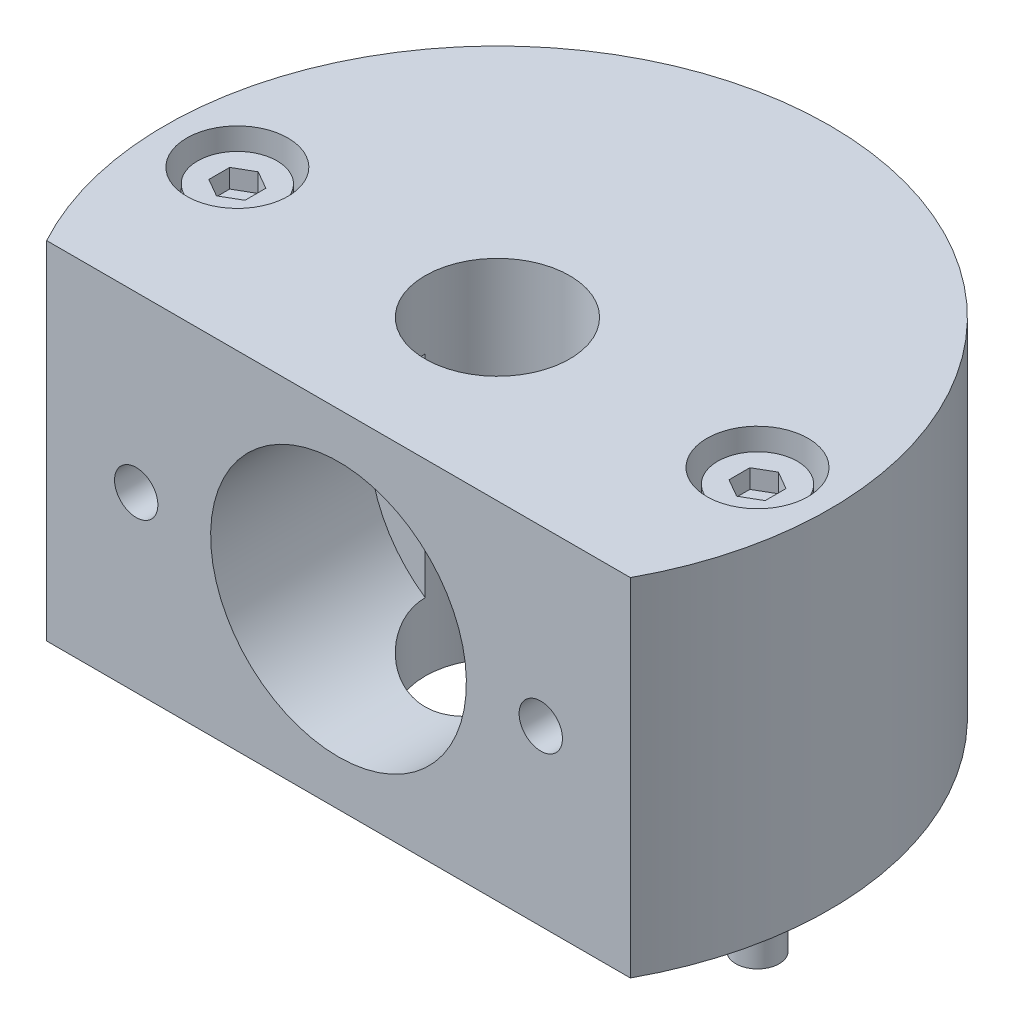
ISO-10303-21;
HEADER;
FILE_DESCRIPTION(('STEP AP214'),'2;1');
FILE_NAME('part.step','',(''),(''),'','','');
FILE_SCHEMA(('AUTOMOTIVE_DESIGN { 1 0 10303 214 1 1 1 1 }'));
ENDSEC;
DATA;
#1=APPLICATION_CONTEXT('core data for automotive mechanical design processes');
#2=APPLICATION_PROTOCOL_DEFINITION('international standard','automotive_design',2000,#1);
#3=PRODUCT_CONTEXT('',#1,'mechanical');
#4=PRODUCT('Part','Part','',(#3));
#5=PRODUCT_RELATED_PRODUCT_CATEGORY('part','',(#4));
#6=PRODUCT_DEFINITION_FORMATION('','',#4);
#7=PRODUCT_DEFINITION_CONTEXT('part definition',#1,'design');
#8=PRODUCT_DEFINITION('design','',#6,#7);
#9=PRODUCT_DEFINITION_SHAPE('','',#8);
#10=(LENGTH_UNIT() NAMED_UNIT(*) SI_UNIT(.MILLI.,.METRE.));
#11=(NAMED_UNIT(*) PLANE_ANGLE_UNIT() SI_UNIT($,.RADIAN.));
#12=(NAMED_UNIT(*) SI_UNIT($,.STERADIAN.) SOLID_ANGLE_UNIT());
#13=UNCERTAINTY_MEASURE_WITH_UNIT(LENGTH_MEASURE(1.E-05),#10,'distance_accuracy_value','');
#14=(GEOMETRIC_REPRESENTATION_CONTEXT(3) GLOBAL_UNCERTAINTY_ASSIGNED_CONTEXT((#13)) GLOBAL_UNIT_ASSIGNED_CONTEXT((#10,
#11,#12)) REPRESENTATION_CONTEXT('',''));
#15=CARTESIAN_POINT('',(0.,0.,0.));
#16=DIRECTION('',(0.,0.,1.));
#17=DIRECTION('',(1.,0.,0.));
#18=AXIS2_PLACEMENT_3D('',#15,#16,#17);
#19=CARTESIAN_POINT('',(12.75,12.,5.));
#20=DIRECTION('',(0.,0.,-1.));
#21=DIRECTION('',(0.,-1.,0.));
#22=AXIS2_PLACEMENT_3D('',#19,#20,#21);
#23=PLANE('',#22);
#24=CARTESIAN_POINT('',(14.,12.0000000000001,5.));
#25=DIRECTION('',(0.,0.,1.));
#26=DIRECTION('',(0.,1.,0.));
#27=AXIS2_PLACEMENT_3D('',#24,#25,#26);
#28=CIRCLE('',#27,1.5);
#29=CARTESIAN_POINT('',(14.,13.5000000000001,4.99999999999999));
#30=VERTEX_POINT('',#29);
#31=EDGE_CURVE('E243',#30,#30,#28,.T.);
#32=ORIENTED_EDGE('',*,*,#31,.T.);
#33=EDGE_LOOP('',(#32));
#34=FACE_BOUND('',#33,.T.);
#35=ADVANCED_FACE('F14',(#34),#23,.F.);
#36=CARTESIAN_POINT('',(14.,12.0000000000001,11.));
#37=DIRECTION('',(0.,0.,1.));
#38=DIRECTION('',(0.,1.,0.));
#39=AXIS2_PLACEMENT_3D('',#36,#37,#38);
#40=CYLINDRICAL_SURFACE('',#39,1.5);
#41=ORIENTED_EDGE('',*,*,#31,.F.);
#42=EDGE_LOOP('',(#41));
#43=FACE_BOUND('',#42,.T.);
#44=CARTESIAN_POINT('',(14.,12.0000000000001,11.));
#45=DIRECTION('',(0.,0.,-1.));
#46=DIRECTION('',(0.,1.,0.));
#47=AXIS2_PLACEMENT_3D('',#44,#45,#46);
#48=CIRCLE('',#47,1.5);
#49=CARTESIAN_POINT('',(14.,13.5000000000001,11.));
#50=VERTEX_POINT('',#49);
#51=EDGE_CURVE('E414',#50,#50,#48,.F.);
#52=ORIENTED_EDGE('',*,*,#51,.T.);
#53=EDGE_LOOP('',(#52));
#54=FACE_BOUND('',#53,.T.);
#55=ADVANCED_FACE('F16',(#43,#54),#40,.F.);
#56=CARTESIAN_POINT('',(20.199009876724,24.,11.));
#57=DIRECTION('',(0.,0.,-1.));
#58=DIRECTION('',(0.,-1.,0.));
#59=AXIS2_PLACEMENT_3D('',#56,#57,#58);
#60=PLANE('',#59);
#61=ORIENTED_EDGE('',*,*,#51,.F.);
#62=EDGE_LOOP('',(#61));
#63=FACE_BOUND('',#62,.T.);
#64=DIRECTION('',(0.,-1.,0.));
#65=VECTOR('',#64,1.);
#66=CARTESIAN_POINT('',(20.199009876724,24.,11.));
#67=LINE('',#66,#65);
#68=CARTESIAN_POINT('',(20.199009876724,24.,11.));
#69=VERTEX_POINT('',#68);
#70=CARTESIAN_POINT('',(20.1990098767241,1.79455226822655E-13,11.));
#71=VERTEX_POINT('',#70);
#72=EDGE_CURVE('E253',#69,#71,#67,.T.);
#73=ORIENTED_EDGE('',*,*,#72,.F.);
#74=DIRECTION('',(-1.,0.,0.));
#75=VECTOR('',#74,1.);
#76=CARTESIAN_POINT('',(-1.6759110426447E-13,24.,11.));
#77=LINE('',#76,#75);
#78=CARTESIAN_POINT('',(-20.1990098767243,24.,11.));
#79=VERTEX_POINT('',#78);
#80=EDGE_CURVE('E28',#69,#79,#77,.T.);
#81=ORIENTED_EDGE('',*,*,#80,.T.);
#82=DIRECTION('',(0.,-1.,0.));
#83=VECTOR('',#82,1.);
#84=CARTESIAN_POINT('',(-20.1990098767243,24.,11.));
#85=LINE('',#84,#83);
#86=CARTESIAN_POINT('',(-20.1990098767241,-1.02642637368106E-13,11.));
#87=VERTEX_POINT('',#86);
#88=EDGE_CURVE('E256',#79,#87,#85,.T.);
#89=ORIENTED_EDGE('',*,*,#88,.T.);
#90=DIRECTION('',(1.,0.,0.));
#91=VECTOR('',#90,1.);
#92=CARTESIAN_POINT('',(20.1990098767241,1.79455226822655E-13,11.));
#93=LINE('',#92,#91);
#94=EDGE_CURVE('E462',#87,#71,#93,.T.);
#95=ORIENTED_EDGE('',*,*,#94,.T.);
#96=EDGE_LOOP('',(#73,#81,#89,#95));
#97=FACE_BOUND('',#96,.T.);
#98=CARTESIAN_POINT('',(0.,12.,11.));
#99=DIRECTION('',(0.,0.,-1.));
#100=DIRECTION('',(0.,-1.,0.));
#101=AXIS2_PLACEMENT_3D('',#98,#99,#100);
#102=CIRCLE('',#101,8.85);
#103=CARTESIAN_POINT('',(0.,3.15,11.));
#104=VERTEX_POINT('',#103);
#105=EDGE_CURVE('E457',#104,#104,#102,.F.);
#106=ORIENTED_EDGE('',*,*,#105,.F.);
#107=EDGE_LOOP('',(#106));
#108=FACE_BOUND('',#107,.T.);
#109=CARTESIAN_POINT('',(-14.,12.,11.));
#110=DIRECTION('',(0.,0.,-1.));
#111=DIRECTION('',(0.,1.,0.));
#112=AXIS2_PLACEMENT_3D('',#109,#110,#111);
#113=CIRCLE('',#112,1.5);
#114=CARTESIAN_POINT('',(-14.,13.5,11.));
#115=VERTEX_POINT('',#114);
#116=EDGE_CURVE('E9',#115,#115,#113,.T.);
#117=ORIENTED_EDGE('',*,*,#116,.T.);
#118=EDGE_LOOP('',(#117));
#119=FACE_BOUND('',#118,.T.);
#120=ADVANCED_FACE('F477',(#63,#97,#108,#119),#60,.F.);
#121=CARTESIAN_POINT('',(0.,0.,0.));
#122=DIRECTION('',(0.,1.,0.));
#123=DIRECTION('',(-1.,0.,0.));
#124=AXIS2_PLACEMENT_3D('',#121,#122,#123);
#125=PLANE('',#124);
#126=CARTESIAN_POINT('',(18.,1.25693328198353E-13,0.));
#127=DIRECTION('',(0.,1.,0.));
#128=DIRECTION('',(-1.,0.,0.));
#129=AXIS2_PLACEMENT_3D('',#126,#127,#128);
#130=CIRCLE('',#129,1.75);
#131=CARTESIAN_POINT('',(16.25,1.13473143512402E-13,0.));
#132=VERTEX_POINT('',#131);
#133=EDGE_CURVE('E236',#132,#132,#130,.T.);
#134=ORIENTED_EDGE('',*,*,#133,.T.);
#135=EDGE_LOOP('',(#134));
#136=FACE_BOUND('',#135,.T.);
#137=CARTESIAN_POINT('',(0.,0.,0.));
#138=DIRECTION('',(0.,1.,0.));
#139=DIRECTION('',(-1.,0.,0.));
#140=AXIS2_PLACEMENT_3D('',#137,#138,#139);
#141=CIRCLE('',#140,5.);
#142=CARTESIAN_POINT('',(-5.,0.,0.));
#143=VERTEX_POINT('',#142);
#144=EDGE_CURVE('E770',#143,#143,#141,.T.);
#145=ORIENTED_EDGE('',*,*,#144,.T.);
#146=EDGE_LOOP('',(#145));
#147=FACE_BOUND('',#146,.T.);
#148=ORIENTED_EDGE('',*,*,#94,.F.);
#149=CARTESIAN_POINT('',(0.,0.,0.));
#150=DIRECTION('',(0.,1.,0.));
#151=DIRECTION('',(-1.,0.,0.));
#152=AXIS2_PLACEMENT_3D('',#149,#150,#151);
#153=CIRCLE('',#152,23.);
#154=EDGE_CURVE('E459',#71,#87,#153,.T.);
#155=ORIENTED_EDGE('',*,*,#154,.F.);
#156=EDGE_LOOP('',(#148,#155));
#157=FACE_BOUND('',#156,.T.);
#158=CARTESIAN_POINT('',(-18.,-1.25693328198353E-13,0.));
#159=DIRECTION('',(0.,1.,0.));
#160=DIRECTION('',(-1.,0.,0.));
#161=AXIS2_PLACEMENT_3D('',#158,#159,#160);
#162=CIRCLE('',#161,1.75);
#163=CARTESIAN_POINT('',(-19.75,-1.37913512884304E-13,0.));
#164=VERTEX_POINT('',#163);
#165=EDGE_CURVE('E464',#164,#164,#162,.T.);
#166=ORIENTED_EDGE('',*,*,#165,.T.);
#167=EDGE_LOOP('',(#166));
#168=FACE_BOUND('',#167,.T.);
#169=ADVANCED_FACE('F481',(#136,#147,#157,#168),#125,.F.);
#170=CARTESIAN_POINT('',(-1.6759110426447E-13,24.,0.));
#171=DIRECTION('',(0.,-1.,0.));
#172=DIRECTION('',(1.,0.,0.));
#173=AXIS2_PLACEMENT_3D('',#170,#171,#172);
#174=CYLINDRICAL_SURFACE('',#173,23.);
#175=ORIENTED_EDGE('',*,*,#88,.F.);
#176=CARTESIAN_POINT('',(-1.6759110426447E-13,24.,0.));
#177=DIRECTION('',(0.,1.,0.));
#178=DIRECTION('',(-1.,0.,0.));
#179=AXIS2_PLACEMENT_3D('',#176,#177,#178);
#180=CIRCLE('',#179,23.);
#181=EDGE_CURVE('E473',#79,#69,#180,.F.);
#182=ORIENTED_EDGE('',*,*,#181,.T.);
#183=ORIENTED_EDGE('',*,*,#72,.T.);
#184=ORIENTED_EDGE('',*,*,#154,.T.);
#185=EDGE_LOOP('',(#175,#182,#183,#184));
#186=FACE_BOUND('',#185,.T.);
#187=ADVANCED_FACE('F476',(#186),#174,.T.);
#188=CARTESIAN_POINT('',(-1.6759110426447E-13,24.,0.));
#189=DIRECTION('',(0.,-1.,0.));
#190=DIRECTION('',(1.,0.,0.));
#191=AXIS2_PLACEMENT_3D('',#188,#189,#190);
#192=CYLINDRICAL_SURFACE('',#191,5.);
#193=ORIENTED_EDGE('',*,*,#144,.F.);
#194=EDGE_LOOP('',(#193));
#195=FACE_BOUND('',#194,.T.);
#196=CARTESIAN_POINT('',(-1.6759110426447E-13,24.,0.));
#197=DIRECTION('',(0.,1.,0.));
#198=DIRECTION('',(-1.,0.,0.));
#199=AXIS2_PLACEMENT_3D('',#196,#197,#198);
#200=CIRCLE('',#199,5.);
#201=CARTESIAN_POINT('',(-5.00000000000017,24.,0.));
#202=VERTEX_POINT('',#201);
#203=EDGE_CURVE('E772',#202,#202,#200,.T.);
#204=ORIENTED_EDGE('',*,*,#203,.T.);
#205=EDGE_LOOP('',(#204));
#206=FACE_BOUND('',#205,.T.);
#207=CARTESIAN_POINT('',(4.99999999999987,19.3022256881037,0.));
#208=CARTESIAN_POINT('',(5.00002648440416,19.3021780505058,0.128135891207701));
#209=CARTESIAN_POINT('',(4.99507539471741,19.305597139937,0.256244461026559));
#210=CARTESIAN_POINT('',(4.97542775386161,19.3190077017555,0.511262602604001));
#211=CARTESIAN_POINT('',(4.96073928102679,19.3289937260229,0.638173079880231));
#212=CARTESIAN_POINT('',(4.92196495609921,19.3550846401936,0.888967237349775));
#213=CARTESIAN_POINT('',(4.89794700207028,19.3711452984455,1.01286606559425));
#214=CARTESIAN_POINT('',(4.8408698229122,19.4087547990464,1.25769484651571));
#215=CARTESIAN_POINT('',(4.80780909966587,19.4303045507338,1.3786243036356));
#216=CARTESIAN_POINT('',(4.69587952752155,19.5019384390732,1.73508205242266));
#217=CARTESIAN_POINT('',(4.6041063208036,19.5591198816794,1.96526830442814));
#218=CARTESIAN_POINT('',(4.38933279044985,19.6858154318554,2.40715136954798));
#219=CARTESIAN_POINT('',(4.26626996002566,19.7553541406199,2.61881001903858));
#220=CARTESIAN_POINT('',(3.97720793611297,19.9078301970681,3.04208564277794));
#221=CARTESIAN_POINT('',(3.80803486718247,19.991406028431,3.25130567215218));
#222=CARTESIAN_POINT('',(3.43798814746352,20.1574375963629,3.64036687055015));
#223=CARTESIAN_POINT('',(3.23710415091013,20.2398929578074,3.82019841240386));
#224=CARTESIAN_POINT('',(2.90464650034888,20.3606954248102,4.07244508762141));
#225=CARTESIAN_POINT('',(2.78292411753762,20.4020960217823,4.15660416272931));
#226=CARTESIAN_POINT('',(2.53163884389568,20.4811921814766,4.3142529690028));
#227=CARTESIAN_POINT('',(2.40207917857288,20.5188892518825,4.3877470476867));
#228=CARTESIAN_POINT('',(2.13591341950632,20.589489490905,4.52329235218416));
#229=CARTESIAN_POINT('',(1.99930975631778,20.6223942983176,4.58534749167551));
#230=CARTESIAN_POINT('',(1.71997299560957,20.6824297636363,4.69726721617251));
#231=CARTESIAN_POINT('',(1.57724077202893,20.7095612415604,4.74713353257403));
#232=CARTESIAN_POINT('',(1.29943128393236,20.7551151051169,4.83017977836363));
#233=CARTESIAN_POINT('',(1.16476468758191,20.774088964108,4.86443225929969));
#234=CARTESIAN_POINT('',(0.892361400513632,20.8059631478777,4.92169221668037));
#235=CARTESIAN_POINT('',(0.754625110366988,20.8188642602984,4.94470115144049));
#236=CARTESIAN_POINT('',(0.477347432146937,20.8382092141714,4.97912087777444));
#237=CARTESIAN_POINT('',(0.337807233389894,20.8446571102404,4.99053895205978));
#238=CARTESIAN_POINT('',(0.0581169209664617,20.8509142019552,5.00162017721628));
#239=CARTESIAN_POINT('',(-0.0820331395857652,20.8507239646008,5.00128433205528));
#240=CARTESIAN_POINT('',(-0.346154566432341,20.8441027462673,4.9895561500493));
#241=CARTESIAN_POINT('',(-0.470200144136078,20.8383646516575,4.97939135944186));
#242=CARTESIAN_POINT('',(-0.716890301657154,20.8217830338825,4.94989946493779));
#243=CARTESIAN_POINT('',(-0.839534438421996,20.8109379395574,4.9305695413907));
#244=CARTESIAN_POINT('',(-1.08249932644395,20.7843962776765,4.88298161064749));
#245=CARTESIAN_POINT('',(-1.2028208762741,20.7687014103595,4.85472673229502));
#246=CARTESIAN_POINT('',(-1.44044129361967,20.7328175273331,4.78960658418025));
#247=CARTESIAN_POINT('',(-1.55773897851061,20.712626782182,4.75273800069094));
#248=CARTESIAN_POINT('',(-1.90613437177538,20.6455329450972,4.6289999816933));
#249=CARTESIAN_POINT('',(-2.13165734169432,20.5923452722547,4.52941037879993));
#250=CARTESIAN_POINT('',(-2.5630654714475,20.4736905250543,4.30006173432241));
#251=CARTESIAN_POINT('',(-2.7689447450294,20.4082197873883,4.17029368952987));
#252=CARTESIAN_POINT('',(-3.17991759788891,20.2621598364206,3.8678504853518));
#253=CARTESIAN_POINT('',(-3.38236787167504,20.180698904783,3.69200564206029));
#254=CARTESIAN_POINT('',(-3.7566160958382,20.0157484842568,3.31048734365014));
#255=CARTESIAN_POINT('',(-3.92837243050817,19.9322564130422,3.1047740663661));
#256=CARTESIAN_POINT('',(-4.16783999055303,19.8077393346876,2.76599540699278));
#257=CARTESIAN_POINT('',(-4.24753136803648,19.7645497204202,2.64202759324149));
#258=CARTESIAN_POINT('',(-4.39610514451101,19.6814059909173,2.38664497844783));
#259=CARTESIAN_POINT('',(-4.46498484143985,19.6414526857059,2.2552283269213));
#260=CARTESIAN_POINT('',(-4.59105329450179,19.5663799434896,1.98601835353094));
#261=CARTESIAN_POINT('',(-4.6482720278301,19.5312481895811,1.84824252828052));
#262=CARTESIAN_POINT('',(-4.75048745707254,19.4671957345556,1.5669178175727));
#263=CARTESIAN_POINT('',(-4.79549399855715,19.4382700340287,1.42337369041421));
#264=CARTESIAN_POINT('',(-4.86124923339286,19.395390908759,1.1745633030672));
#265=CARTESIAN_POINT('',(-4.88523867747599,19.3795366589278,1.07046882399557));
#266=CARTESIAN_POINT('',(-4.92656966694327,19.352008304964,0.860442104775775));
#267=CARTESIAN_POINT('',(-4.94391316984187,19.3403329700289,0.754510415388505));
#268=CARTESIAN_POINT('',(-4.97183302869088,19.3214533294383,0.540857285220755));
#269=CARTESIAN_POINT('',(-4.98237763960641,19.3142700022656,0.433129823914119));
#270=CARTESIAN_POINT('',(-4.99647051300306,19.3046420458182,0.216939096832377));
#271=CARTESIAN_POINT('',(-5.00001423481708,19.302200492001,0.108475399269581));
#272=CARTESIAN_POINT('',(-5.00000000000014,19.3022256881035,0.));
#273=B_SPLINE_CURVE_WITH_KNOTS('',3,(#207,#208,#209,#210,#211,#212,#213,#214,#215,#216,#217,
#218,#219,#220,#221,#222,#223,#224,#225,#226,#227,#228,#229,#230,#231,#232,#233,#234,#235,#236,
#237,#238,#239,#240,#241,#242,#243,#244,#245,#246,#247,#248,#249,#250,#251,#252,#253,#254,#255,
#256,#257,#258,#259,#260,#261,#262,#263,#264,#265,#266,#267,#268,#269,#270,#271,#272),
.UNSPECIFIED.,.F.,.F.,(4,2,2,2,2,2,2,2,2,2,2,2,2,2,2,2,2,2,2,2,2,2,2,2,2,2,2,2,2,2,2,2,4),(0.,
0.384222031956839,0.768125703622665,1.14928622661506,1.53050993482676,2.28997373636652,
3.05096679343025,3.89286756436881,4.73504357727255,5.19552222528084,5.65581263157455,
6.11594526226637,6.5760124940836,6.99615288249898,7.41623876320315,7.83606053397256,
8.25584644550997,8.62918178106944,9.0026320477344,9.37595153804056,9.74941488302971,
10.5026594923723,11.2561291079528,12.0935485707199,12.9320949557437,13.3923122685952,
13.8526444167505,14.3117778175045,14.7705399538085,15.0942462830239,15.4178571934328,
15.7429683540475,16.0682903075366),.UNSPECIFIED.);
#274=CARTESIAN_POINT('',(4.99999999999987,19.3022256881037,0.));
#275=VERTEX_POINT('',#274);
#276=CARTESIAN_POINT('',(-5.00000000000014,19.3022256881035,0.));
#277=VERTEX_POINT('',#276);
#278=EDGE_CURVE('E270',#275,#277,#273,.T.);
#279=ORIENTED_EDGE('',*,*,#278,.T.);
#280=DIRECTION('',(0.,-1.,0.));
#281=VECTOR('',#280,1.);
#282=CARTESIAN_POINT('',(-5.00000000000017,24.,0.));
#283=LINE('',#282,#281);
#284=CARTESIAN_POINT('',(-5.,4.69777431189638,0.));
#285=VERTEX_POINT('',#284);
#286=EDGE_CURVE('E765',#277,#285,#283,.T.);
#287=ORIENTED_EDGE('',*,*,#286,.T.);
#288=CARTESIAN_POINT('',(-5.,4.69777431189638,0.));
#289=CARTESIAN_POINT('',(-5.00002648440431,4.69782194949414,0.128135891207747));
#290=CARTESIAN_POINT('',(-4.99507539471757,4.69440286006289,0.256244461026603));
#291=CARTESIAN_POINT('',(-4.97542775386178,4.68099229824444,0.511262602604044));
#292=CARTESIAN_POINT('',(-4.96073928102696,4.67100627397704,0.638173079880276));
#293=CARTESIAN_POINT('',(-4.92196495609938,4.64491535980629,0.888967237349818));
#294=CARTESIAN_POINT('',(-4.89794700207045,4.6288547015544,1.01286606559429));
#295=CARTESIAN_POINT('',(-4.84086982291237,4.59124520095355,1.25769484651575));
#296=CARTESIAN_POINT('',(-4.80780909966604,4.56969544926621,1.37862430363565));
#297=CARTESIAN_POINT('',(-4.69587952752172,4.49806156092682,1.73508205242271));
#298=CARTESIAN_POINT('',(-4.60410632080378,4.44088011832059,1.96526830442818));
#299=CARTESIAN_POINT('',(-4.38933279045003,4.31418456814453,2.40715136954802));
#300=CARTESIAN_POINT('',(-4.26626996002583,4.24464585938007,2.61881001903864));
#301=CARTESIAN_POINT('',(-3.97720793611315,4.09216980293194,3.04208564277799));
#302=CARTESIAN_POINT('',(-3.80803486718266,4.00859397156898,3.25130567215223));
#303=CARTESIAN_POINT('',(-3.43798814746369,3.84256240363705,3.64036687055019));
#304=CARTESIAN_POINT('',(-3.23710415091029,3.7601070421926,3.82019841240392));
#305=CARTESIAN_POINT('',(-2.90464650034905,3.63930457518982,4.07244508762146));
#306=CARTESIAN_POINT('',(-2.7829241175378,3.59790397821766,4.15660416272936));
#307=CARTESIAN_POINT('',(-2.53163884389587,3.5188078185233,4.31425296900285));
#308=CARTESIAN_POINT('',(-2.40207917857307,3.48111074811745,4.38774704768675));
#309=CARTESIAN_POINT('',(-2.13591341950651,3.41051050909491,4.52329235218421));
#310=CARTESIAN_POINT('',(-1.99930975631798,3.37760570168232,4.58534749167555));
#311=CARTESIAN_POINT('',(-1.71997299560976,3.31757023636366,4.69726721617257));
#312=CARTESIAN_POINT('',(-1.5772407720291,3.29043875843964,4.74713353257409));
#313=CARTESIAN_POINT('',(-1.29943128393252,3.24488489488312,4.83017977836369));
#314=CARTESIAN_POINT('',(-1.16476468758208,3.22591103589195,4.86443225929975));
#315=CARTESIAN_POINT('',(-0.892361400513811,3.19403685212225,4.92169221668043));
#316=CARTESIAN_POINT('',(-0.754625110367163,3.18113573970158,4.94470115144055));
#317=CARTESIAN_POINT('',(-0.477347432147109,3.16179078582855,4.97912087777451));
#318=CARTESIAN_POINT('',(-0.337807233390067,3.1553428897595,4.99053895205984));
#319=CARTESIAN_POINT('',(-0.0581169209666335,3.14908579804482,5.00162017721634));
#320=CARTESIAN_POINT('',(0.0820331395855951,3.14927603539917,5.00128433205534));
#321=CARTESIAN_POINT('',(0.346154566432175,3.15589725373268,4.98955615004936));
#322=CARTESIAN_POINT('',(0.470200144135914,3.16163534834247,4.97939135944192));
#323=CARTESIAN_POINT('',(0.716890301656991,3.17821696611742,4.94989946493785));
#324=CARTESIAN_POINT('',(0.839534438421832,3.18906206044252,4.93056954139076));
#325=CARTESIAN_POINT('',(1.08249932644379,3.21560372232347,4.88298161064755));
#326=CARTESIAN_POINT('',(1.20282087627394,3.23129858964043,4.85472673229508));
#327=CARTESIAN_POINT('',(1.44044129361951,3.26718247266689,4.78960658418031));
#328=CARTESIAN_POINT('',(1.55773897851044,3.28737321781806,4.752738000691));
#329=CARTESIAN_POINT('',(1.90613437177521,3.35446705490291,4.62899998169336));
#330=CARTESIAN_POINT('',(2.13165734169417,3.40765472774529,4.52941037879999));
#331=CARTESIAN_POINT('',(2.56306547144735,3.52630947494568,4.30006173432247));
#332=CARTESIAN_POINT('',(2.76894474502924,3.59178021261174,4.17029368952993));
#333=CARTESIAN_POINT('',(3.17991759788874,3.73784016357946,3.86785048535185));
#334=CARTESIAN_POINT('',(3.38236787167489,3.81930109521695,3.69200564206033));
#335=CARTESIAN_POINT('',(3.75661609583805,3.98425151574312,3.31048734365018));
#336=CARTESIAN_POINT('',(3.92837243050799,4.06774358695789,3.10477406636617));
#337=CARTESIAN_POINT('',(4.16783999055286,4.19226066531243,2.76599540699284));
#338=CARTESIAN_POINT('',(4.24753136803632,4.23545027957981,2.64202759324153));
#339=CARTESIAN_POINT('',(4.39610514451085,4.31859400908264,2.38664497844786));
#340=CARTESIAN_POINT('',(4.46498484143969,4.35854731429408,2.25522832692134));
#341=CARTESIAN_POINT('',(4.59105329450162,4.43362005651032,1.98601835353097));
#342=CARTESIAN_POINT('',(4.64827202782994,4.46875181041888,1.84824252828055));
#343=CARTESIAN_POINT('',(4.75048745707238,4.53280426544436,1.56691781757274));
#344=CARTESIAN_POINT('',(4.79549399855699,4.56172996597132,1.42337369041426));
#345=CARTESIAN_POINT('',(4.8612492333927,4.604609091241,1.17456330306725));
#346=CARTESIAN_POINT('',(4.88523867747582,4.62046334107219,1.07046882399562));
#347=CARTESIAN_POINT('',(4.9265696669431,4.64799169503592,0.860442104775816));
#348=CARTESIAN_POINT('',(4.94391316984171,4.65966702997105,0.754510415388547));
#349=CARTESIAN_POINT('',(4.97183302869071,4.67854667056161,0.540857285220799));
#350=CARTESIAN_POINT('',(4.98237763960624,4.68572999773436,0.433129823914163));
#351=CARTESIAN_POINT('',(4.9964705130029,4.69535795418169,0.216939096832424));
#352=CARTESIAN_POINT('',(5.00001423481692,4.69779950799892,0.108475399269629));
#353=CARTESIAN_POINT('',(5.,4.69777431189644,0.));
#354=B_SPLINE_CURVE_WITH_KNOTS('',3,(#288,#289,#290,#291,#292,#293,#294,#295,#296,#297,#298,
#299,#300,#301,#302,#303,#304,#305,#306,#307,#308,#309,#310,#311,#312,#313,#314,#315,#316,#317,
#318,#319,#320,#321,#322,#323,#324,#325,#326,#327,#328,#329,#330,#331,#332,#333,#334,#335,#336,
#337,#338,#339,#340,#341,#342,#343,#344,#345,#346,#347,#348,#349,#350,#351,#352,#353),
.UNSPECIFIED.,.F.,.F.,(4,2,2,2,2,2,2,2,2,2,2,2,2,2,2,2,2,2,2,2,2,2,2,2,2,2,2,2,2,2,2,2,4),(0.,
0.384222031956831,0.768125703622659,1.14928622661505,1.53050993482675,2.2899737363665,
3.05096679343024,3.89286756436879,4.73504357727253,5.19552222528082,5.65581263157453,
6.11594526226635,6.57601249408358,6.99615288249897,7.41623876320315,7.83606053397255,
8.25584644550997,8.62918178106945,9.0026320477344,9.37595153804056,9.74941488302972,
10.5026594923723,11.2561291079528,12.0935485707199,12.9320949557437,13.3923122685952,
13.8526444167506,14.3117778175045,14.7705399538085,15.0942462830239,15.4178571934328,
15.7429683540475,16.0682903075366),.UNSPECIFIED.);
#355=CARTESIAN_POINT('',(5.,4.69777431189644,0.));
#356=VERTEX_POINT('',#355);
#357=EDGE_CURVE('E261',#285,#356,#354,.T.);
#358=ORIENTED_EDGE('',*,*,#357,.T.);
#359=DIRECTION('',(0.,-1.,0.));
#360=VECTOR('',#359,1.);
#361=CARTESIAN_POINT('',(4.99999999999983,24.,0.));
#362=LINE('',#361,#360);
#363=EDGE_CURVE('E258',#356,#275,#362,.F.);
#364=ORIENTED_EDGE('',*,*,#363,.T.);
#365=EDGE_LOOP('',(#279,#287,#358,#364));
#366=FACE_BOUND('',#365,.T.);
#367=ADVANCED_FACE('F276',(#195,#206,#366),#192,.F.);
#368=CARTESIAN_POINT('',(-1.6759110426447E-13,24.,0.));
#369=DIRECTION('',(0.,1.,0.));
#370=DIRECTION('',(-1.,0.,0.));
#371=AXIS2_PLACEMENT_3D('',#368,#369,#370);
#372=PLANE('',#371);
#373=ORIENTED_EDGE('',*,*,#80,.F.);
#374=ORIENTED_EDGE('',*,*,#181,.F.);
#375=EDGE_LOOP('',(#373,#374));
#376=FACE_BOUND('',#375,.T.);
#377=CARTESIAN_POINT('',(18.,24.,0.));
#378=DIRECTION('',(0.,1.,0.));
#379=DIRECTION('',(-1.,0.,0.));
#380=AXIS2_PLACEMENT_3D('',#377,#378,#379);
#381=CIRCLE('',#380,3.5);
#382=CARTESIAN_POINT('',(14.5,24.,0.));
#383=VERTEX_POINT('',#382);
#384=EDGE_CURVE('E470',#383,#383,#381,.T.);
#385=ORIENTED_EDGE('',*,*,#384,.F.);
#386=EDGE_LOOP('',(#385));
#387=FACE_BOUND('',#386,.T.);
#388=CARTESIAN_POINT('',(-18.,24.,0.));
#389=DIRECTION('',(0.,1.,0.));
#390=DIRECTION('',(-1.,0.,0.));
#391=AXIS2_PLACEMENT_3D('',#388,#389,#390);
#392=CIRCLE('',#391,3.5);
#393=CARTESIAN_POINT('',(-21.5,24.,0.));
#394=VERTEX_POINT('',#393);
#395=EDGE_CURVE('E467',#394,#394,#392,.T.);
#396=ORIENTED_EDGE('',*,*,#395,.F.);
#397=EDGE_LOOP('',(#396));
#398=FACE_BOUND('',#397,.T.);
#399=ORIENTED_EDGE('',*,*,#203,.F.);
#400=EDGE_LOOP('',(#399));
#401=FACE_BOUND('',#400,.T.);
#402=ADVANCED_FACE('F498',(#376,#387,#398,#401),#372,.T.);
#403=CARTESIAN_POINT('',(0.,12.,0.));
#404=DIRECTION('',(0.,0.,1.));
#405=DIRECTION('',(0.,1.,0.));
#406=AXIS2_PLACEMENT_3D('',#403,#404,#405);
#407=PLANE('',#406);
#408=CARTESIAN_POINT('',(0.,12.,0.));
#409=DIRECTION('',(0.,0.,1.));
#410=DIRECTION('',(0.,1.,0.));
#411=AXIS2_PLACEMENT_3D('',#408,#409,#410);
#412=CIRCLE('',#411,8.85);
#413=EDGE_CURVE('E250',#277,#285,#412,.T.);
#414=ORIENTED_EDGE('',*,*,#413,.T.);
#415=ORIENTED_EDGE('',*,*,#286,.F.);
#416=EDGE_LOOP('',(#414,#415));
#417=FACE_BOUND('',#416,.T.);
#418=ADVANCED_FACE('F284',(#417),#407,.T.);
#419=CARTESIAN_POINT('',(0.,12.,11.));
#420=DIRECTION('',(0.,0.,-1.));
#421=DIRECTION('',(0.,-1.,0.));
#422=AXIS2_PLACEMENT_3D('',#419,#420,#421);
#423=CYLINDRICAL_SURFACE('',#422,8.85);
#424=ORIENTED_EDGE('',*,*,#105,.T.);
#425=EDGE_LOOP('',(#424));
#426=FACE_BOUND('',#425,.T.);
#427=EDGE_CURVE('E249',#356,#275,#412,.T.);
#428=ORIENTED_EDGE('',*,*,#427,.F.);
#429=ORIENTED_EDGE('',*,*,#357,.F.);
#430=ORIENTED_EDGE('',*,*,#413,.F.);
#431=ORIENTED_EDGE('',*,*,#278,.F.);
#432=EDGE_LOOP('',(#428,#429,#430,#431));
#433=FACE_BOUND('',#432,.T.);
#434=ADVANCED_FACE('F279',(#426,#433),#423,.F.);
#435=ORIENTED_EDGE('',*,*,#427,.T.);
#436=ORIENTED_EDGE('',*,*,#363,.F.);
#437=EDGE_LOOP('',(#435,#436));
#438=FACE_BOUND('',#437,.T.);
#439=ADVANCED_FACE('F283',(#438),#407,.T.);
#440=CARTESIAN_POINT('',(-18.,24.,0.));
#441=DIRECTION('',(0.,1.,0.));
#442=DIRECTION('',(-1.,0.,0.));
#443=AXIS2_PLACEMENT_3D('',#440,#441,#442);
#444=CYLINDRICAL_SURFACE('',#443,3.5);
#445=CARTESIAN_POINT('',(-18.,20.,0.));
#446=DIRECTION('',(0.,1.,0.));
#447=DIRECTION('',(-1.,0.,0.));
#448=AXIS2_PLACEMENT_3D('',#445,#446,#447);
#449=CIRCLE('',#448,3.5);
#450=CARTESIAN_POINT('',(-21.5,20.,0.));
#451=VERTEX_POINT('',#450);
#452=EDGE_CURVE('E240',#451,#451,#449,.T.);
#453=ORIENTED_EDGE('',*,*,#452,.F.);
#454=EDGE_LOOP('',(#453));
#455=FACE_BOUND('',#454,.T.);
#456=ORIENTED_EDGE('',*,*,#395,.T.);
#457=EDGE_LOOP('',(#456));
#458=FACE_BOUND('',#457,.T.);
#459=ADVANCED_FACE('F289',(#455,#458),#444,.F.);
#460=CARTESIAN_POINT('',(-21.5,20.,0.));
#461=DIRECTION('',(0.,-1.,0.));
#462=DIRECTION('',(1.,0.,0.));
#463=AXIS2_PLACEMENT_3D('',#460,#461,#462);
#464=PLANE('',#463);
#465=CARTESIAN_POINT('',(-18.,20.,0.));
#466=DIRECTION('',(0.,-1.,0.));
#467=DIRECTION('',(1.,0.,0.));
#468=AXIS2_PLACEMENT_3D('',#465,#466,#467);
#469=CIRCLE('',#468,2.75);
#470=CARTESIAN_POINT('',(-15.25,20.,0.));
#471=VERTEX_POINT('',#470);
#472=EDGE_CURVE('E409',#471,#471,#469,.F.);
#473=ORIENTED_EDGE('',*,*,#472,.F.);
#474=EDGE_LOOP('',(#473));
#475=FACE_BOUND('',#474,.T.);
#476=ORIENTED_EDGE('',*,*,#452,.T.);
#477=EDGE_LOOP('',(#476));
#478=FACE_BOUND('',#477,.T.);
#479=ADVANCED_FACE('F300',(#475,#478),#464,.F.);
#480=CARTESIAN_POINT('',(-18.,24.,0.));
#481=DIRECTION('',(0.,1.,0.));
#482=DIRECTION('',(-1.,0.,0.));
#483=AXIS2_PLACEMENT_3D('',#480,#481,#482);
#484=CYLINDRICAL_SURFACE('',#483,1.75);
#485=CARTESIAN_POINT('',(-18.,20.,0.));
#486=DIRECTION('',(0.,1.,0.));
#487=DIRECTION('',(-1.,0.,0.));
#488=AXIS2_PLACEMENT_3D('',#485,#486,#487);
#489=CIRCLE('',#488,1.75);
#490=CARTESIAN_POINT('',(-19.75,20.,0.));
#491=VERTEX_POINT('',#490);
#492=EDGE_CURVE('E233',#491,#491,#489,.F.);
#493=ORIENTED_EDGE('',*,*,#492,.F.);
#494=EDGE_LOOP('',(#493));
#495=FACE_BOUND('',#494,.T.);
#496=ORIENTED_EDGE('',*,*,#165,.F.);
#497=EDGE_LOOP('',(#496));
#498=FACE_BOUND('',#497,.T.);
#499=ADVANCED_FACE('F303',(#495,#498),#484,.F.);
#500=CARTESIAN_POINT('',(18.,24.,0.));
#501=DIRECTION('',(0.,1.,0.));
#502=DIRECTION('',(-1.,0.,0.));
#503=AXIS2_PLACEMENT_3D('',#500,#501,#502);
#504=CYLINDRICAL_SURFACE('',#503,1.75);
#505=CARTESIAN_POINT('',(18.,20.,0.));
#506=DIRECTION('',(0.,1.,0.));
#507=DIRECTION('',(-1.,0.,0.));
#508=AXIS2_PLACEMENT_3D('',#505,#506,#507);
#509=CIRCLE('',#508,1.75);
#510=CARTESIAN_POINT('',(16.25,20.,0.));
#511=VERTEX_POINT('',#510);
#512=EDGE_CURVE('E136',#511,#511,#509,.F.);
#513=ORIENTED_EDGE('',*,*,#512,.F.);
#514=EDGE_LOOP('',(#513));
#515=FACE_BOUND('',#514,.T.);
#516=ORIENTED_EDGE('',*,*,#133,.F.);
#517=EDGE_LOOP('',(#516));
#518=FACE_BOUND('',#517,.T.);
#519=ADVANCED_FACE('F309',(#515,#518),#504,.F.);
#520=CARTESIAN_POINT('',(14.4999999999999,20.,0.));
#521=DIRECTION('',(0.,-1.,0.));
#522=DIRECTION('',(1.,0.,0.));
#523=AXIS2_PLACEMENT_3D('',#520,#521,#522);
#524=PLANE('',#523);
#525=CARTESIAN_POINT('',(18.,20.,0.));
#526=DIRECTION('',(0.,-1.,0.));
#527=DIRECTION('',(1.,0.,0.));
#528=AXIS2_PLACEMENT_3D('',#525,#526,#527);
#529=CIRCLE('',#528,2.75);
#530=CARTESIAN_POINT('',(20.75,20.,0.));
#531=VERTEX_POINT('',#530);
#532=EDGE_CURVE('E22',#531,#531,#529,.F.);
#533=ORIENTED_EDGE('',*,*,#532,.F.);
#534=EDGE_LOOP('',(#533));
#535=FACE_BOUND('',#534,.T.);
#536=CARTESIAN_POINT('',(18.,20.,0.));
#537=DIRECTION('',(0.,1.,0.));
#538=DIRECTION('',(-1.,0.,0.));
#539=AXIS2_PLACEMENT_3D('',#536,#537,#538);
#540=CIRCLE('',#539,3.5);
#541=CARTESIAN_POINT('',(14.5,20.,0.));
#542=VERTEX_POINT('',#541);
#543=EDGE_CURVE('E237',#542,#542,#540,.T.);
#544=ORIENTED_EDGE('',*,*,#543,.T.);
#545=EDGE_LOOP('',(#544));
#546=FACE_BOUND('',#545,.T.);
#547=ADVANCED_FACE('F305',(#535,#546),#524,.F.);
#548=CARTESIAN_POINT('',(18.,24.,0.));
#549=DIRECTION('',(0.,1.,0.));
#550=DIRECTION('',(-1.,0.,0.));
#551=AXIS2_PLACEMENT_3D('',#548,#549,#550);
#552=CYLINDRICAL_SURFACE('',#551,3.5);
#553=ORIENTED_EDGE('',*,*,#543,.F.);
#554=EDGE_LOOP('',(#553));
#555=FACE_BOUND('',#554,.T.);
#556=ORIENTED_EDGE('',*,*,#384,.T.);
#557=EDGE_LOOP('',(#556));
#558=FACE_BOUND('',#557,.T.);
#559=ADVANCED_FACE('F308',(#555,#558),#552,.F.);
#560=CARTESIAN_POINT('',(-18.,-5.00000000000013,0.));
#561=DIRECTION('',(0.,1.,0.));
#562=DIRECTION('',(-1.,0.,0.));
#563=AXIS2_PLACEMENT_3D('',#560,#561,#562);
#564=PLANE('',#563);
#565=CARTESIAN_POINT('',(-18.,-5.00000000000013,0.));
#566=DIRECTION('',(0.,1.,0.));
#567=DIRECTION('',(-1.,0.,0.));
#568=AXIS2_PLACEMENT_3D('',#565,#566,#567);
#569=CIRCLE('',#568,1.5);
#570=CARTESIAN_POINT('',(-19.5,-5.00000000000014,0.));
#571=VERTEX_POINT('',#570);
#572=EDGE_CURVE('E225',#571,#571,#569,.T.);
#573=ORIENTED_EDGE('',*,*,#572,.F.);
#574=EDGE_LOOP('',(#573));
#575=FACE_BOUND('',#574,.T.);
#576=ADVANCED_FACE('F327',(#575),#564,.F.);
#577=CARTESIAN_POINT('',(-18.,-5.00000000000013,0.));
#578=DIRECTION('',(0.,1.,0.));
#579=DIRECTION('',(-1.,0.,0.));
#580=AXIS2_PLACEMENT_3D('',#577,#578,#579);
#581=CYLINDRICAL_SURFACE('',#580,1.5);
#582=ORIENTED_EDGE('',*,*,#572,.T.);
#583=EDGE_LOOP('',(#582));
#584=FACE_BOUND('',#583,.T.);
#585=CARTESIAN_POINT('',(-18.,20.,0.));
#586=DIRECTION('',(0.,1.,0.));
#587=DIRECTION('',(-1.,0.,0.));
#588=AXIS2_PLACEMENT_3D('',#585,#586,#587);
#589=CIRCLE('',#588,1.5);
#590=CARTESIAN_POINT('',(-19.5,20.,0.));
#591=VERTEX_POINT('',#590);
#592=EDGE_CURVE('E214',#591,#591,#589,.T.);
#593=ORIENTED_EDGE('',*,*,#592,.F.);
#594=EDGE_LOOP('',(#593));
#595=FACE_BOUND('',#594,.T.);
#596=ADVANCED_FACE('F319',(#584,#595),#581,.T.);
#597=CARTESIAN_POINT('',(-18.,20.,0.));
#598=DIRECTION('',(0.,1.,0.));
#599=DIRECTION('',(-1.,0.,0.));
#600=AXIS2_PLACEMENT_3D('',#597,#598,#599);
#601=PLANE('',#600);
#602=ORIENTED_EDGE('',*,*,#592,.T.);
#603=EDGE_LOOP('',(#602));
#604=FACE_BOUND('',#603,.T.);
#605=ORIENTED_EDGE('',*,*,#492,.T.);
#606=EDGE_LOOP('',(#605));
#607=FACE_BOUND('',#606,.T.);
#608=ADVANCED_FACE('F315',(#604,#607),#601,.F.);
#609=CARTESIAN_POINT('',(-18.,23.,0.));
#610=DIRECTION('',(0.,-1.,0.));
#611=DIRECTION('',(1.,0.,0.));
#612=AXIS2_PLACEMENT_3D('',#609,#610,#611);
#613=CYLINDRICAL_SURFACE('',#612,2.75);
#614=CARTESIAN_POINT('',(-18.,23.,0.));
#615=DIRECTION('',(0.,1.,0.));
#616=DIRECTION('',(-1.,0.,0.));
#617=AXIS2_PLACEMENT_3D('',#614,#615,#616);
#618=CIRCLE('',#617,2.75);
#619=CARTESIAN_POINT('',(-20.75,23.,0.));
#620=VERTEX_POINT('',#619);
#621=EDGE_CURVE('E228',#620,#620,#618,.T.);
#622=ORIENTED_EDGE('',*,*,#621,.F.);
#623=EDGE_LOOP('',(#622));
#624=FACE_BOUND('',#623,.T.);
#625=ORIENTED_EDGE('',*,*,#472,.T.);
#626=EDGE_LOOP('',(#625));
#627=FACE_BOUND('',#626,.T.);
#628=ADVANCED_FACE('F311',(#624,#627),#613,.T.);
#629=CARTESIAN_POINT('',(-18.,23.,0.));
#630=DIRECTION('',(0.,1.,0.));
#631=DIRECTION('',(-1.,0.,0.));
#632=AXIS2_PLACEMENT_3D('',#629,#630,#631);
#633=PLANE('',#632);
#634=DIRECTION('',(0.866025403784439,0.,0.5));
#635=VECTOR('',#634,1.);
#636=CARTESIAN_POINT('',(-19.25,23.,0.721687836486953));
#637=LINE('',#636,#635);
#638=CARTESIAN_POINT('',(-19.25,23.,0.721687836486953));
#639=VERTEX_POINT('',#638);
#640=CARTESIAN_POINT('',(-18.,23.,1.44337567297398));
#641=VERTEX_POINT('',#640);
#642=EDGE_CURVE('E176',#639,#641,#637,.T.);
#643=ORIENTED_EDGE('',*,*,#642,.F.);
#644=DIRECTION('',(0.,0.,1.));
#645=VECTOR('',#644,1.);
#646=CARTESIAN_POINT('',(-19.25,23.,-0.721687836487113));
#647=LINE('',#646,#645);
#648=CARTESIAN_POINT('',(-19.25,23.,-0.721687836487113));
#649=VERTEX_POINT('',#648);
#650=EDGE_CURVE('E181',#649,#639,#647,.T.);
#651=ORIENTED_EDGE('',*,*,#650,.F.);
#652=DIRECTION('',(-0.866025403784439,0.,0.5));
#653=VECTOR('',#652,1.);
#654=CARTESIAN_POINT('',(-18.,23.,-1.44337567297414));
#655=LINE('',#654,#653);
#656=CARTESIAN_POINT('',(-18.,23.,-1.44337567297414));
#657=VERTEX_POINT('',#656);
#658=EDGE_CURVE('E207',#657,#649,#655,.T.);
#659=ORIENTED_EDGE('',*,*,#658,.F.);
#660=DIRECTION('',(-0.866025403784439,0.,-0.5));
#661=VECTOR('',#660,1.);
#662=CARTESIAN_POINT('',(-16.75,23.,-0.721687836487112));
#663=LINE('',#662,#661);
#664=CARTESIAN_POINT('',(-16.75,23.,-0.721687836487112));
#665=VERTEX_POINT('',#664);
#666=EDGE_CURVE('E204',#665,#657,#663,.T.);
#667=ORIENTED_EDGE('',*,*,#666,.F.);
#668=DIRECTION('',(0.,0.,-1.));
#669=VECTOR('',#668,1.);
#670=CARTESIAN_POINT('',(-16.75,23.,0.721687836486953));
#671=LINE('',#670,#669);
#672=CARTESIAN_POINT('',(-16.75,23.,0.721687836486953));
#673=VERTEX_POINT('',#672);
#674=EDGE_CURVE('E201',#673,#665,#671,.T.);
#675=ORIENTED_EDGE('',*,*,#674,.F.);
#676=DIRECTION('',(0.866025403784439,0.,-0.5));
#677=VECTOR('',#676,1.);
#678=CARTESIAN_POINT('',(-18.,23.,1.44337567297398));
#679=LINE('',#678,#677);
#680=EDGE_CURVE('E198',#641,#673,#679,.T.);
#681=ORIENTED_EDGE('',*,*,#680,.F.);
#682=EDGE_LOOP('',(#643,#651,#659,#667,#675,#681));
#683=FACE_BOUND('',#682,.T.);
#684=ORIENTED_EDGE('',*,*,#621,.T.);
#685=EDGE_LOOP('',(#684));
#686=FACE_BOUND('',#685,.T.);
#687=ADVANCED_FACE('F314',(#683,#686),#633,.T.);
#688=CARTESIAN_POINT('',(-19.25,21.7,0.721687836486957));
#689=DIRECTION('',(-0.5,0.,0.866025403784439));
#690=DIRECTION('',(0.866025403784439,0.,0.5));
#691=AXIS2_PLACEMENT_3D('',#688,#689,#690);
#692=PLANE('',#691);
#693=ORIENTED_EDGE('',*,*,#642,.T.);
#694=DIRECTION('',(0.,1.,0.));
#695=VECTOR('',#694,1.);
#696=CARTESIAN_POINT('',(-18.,21.7,1.44337567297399));
#697=LINE('',#696,#695);
#698=CARTESIAN_POINT('',(-18.,21.7,1.44337567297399));
#699=VERTEX_POINT('',#698);
#700=EDGE_CURVE('E196',#699,#641,#697,.T.);
#701=ORIENTED_EDGE('',*,*,#700,.F.);
#702=DIRECTION('',(0.866025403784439,0.,0.5));
#703=VECTOR('',#702,1.);
#704=CARTESIAN_POINT('',(-19.25,21.7,0.721687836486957));
#705=LINE('',#704,#703);
#706=CARTESIAN_POINT('',(-19.25,21.7,0.721687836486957));
#707=VERTEX_POINT('',#706);
#708=EDGE_CURVE('E177',#707,#699,#705,.T.);
#709=ORIENTED_EDGE('',*,*,#708,.F.);
#710=DIRECTION('',(0.,1.,0.));
#711=VECTOR('',#710,1.);
#712=CARTESIAN_POINT('',(-19.25,21.7,0.721687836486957));
#713=LINE('',#712,#711);
#714=EDGE_CURVE('E212',#707,#639,#713,.T.);
#715=ORIENTED_EDGE('',*,*,#714,.T.);
#716=EDGE_LOOP('',(#693,#701,#709,#715));
#717=FACE_BOUND('',#716,.T.);
#718=ADVANCED_FACE('F323',(#717),#692,.F.);
#719=CARTESIAN_POINT('',(-19.25,21.7,-0.721687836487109));
#720=DIRECTION('',(-1.,0.,0.));
#721=DIRECTION('',(0.,0.,1.));
#722=AXIS2_PLACEMENT_3D('',#719,#720,#721);
#723=PLANE('',#722);
#724=ORIENTED_EDGE('',*,*,#650,.T.);
#725=ORIENTED_EDGE('',*,*,#714,.F.);
#726=DIRECTION('',(0.,0.,1.));
#727=VECTOR('',#726,1.);
#728=CARTESIAN_POINT('',(-19.25,21.7,-0.721687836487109));
#729=LINE('',#728,#727);
#730=CARTESIAN_POINT('',(-19.25,21.7,-0.721687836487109));
#731=VERTEX_POINT('',#730);
#732=EDGE_CURVE('E193',#731,#707,#729,.T.);
#733=ORIENTED_EDGE('',*,*,#732,.F.);
#734=DIRECTION('',(0.,1.,0.));
#735=VECTOR('',#734,1.);
#736=CARTESIAN_POINT('',(-19.25,21.7,-0.721687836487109));
#737=LINE('',#736,#735);
#738=EDGE_CURVE('E215',#731,#649,#737,.T.);
#739=ORIENTED_EDGE('',*,*,#738,.T.);
#740=EDGE_LOOP('',(#724,#725,#733,#739));
#741=FACE_BOUND('',#740,.T.);
#742=ADVANCED_FACE('F334',(#741),#723,.F.);
#743=CARTESIAN_POINT('',(-18.,21.7,-1.44337567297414));
#744=DIRECTION('',(-0.5,0.,-0.866025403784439));
#745=DIRECTION('',(-0.866025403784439,0.,0.5));
#746=AXIS2_PLACEMENT_3D('',#743,#744,#745);
#747=PLANE('',#746);
#748=ORIENTED_EDGE('',*,*,#658,.T.);
#749=ORIENTED_EDGE('',*,*,#738,.F.);
#750=DIRECTION('',(-0.866025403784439,0.,0.5));
#751=VECTOR('',#750,1.);
#752=CARTESIAN_POINT('',(-18.,21.7,-1.44337567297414));
#753=LINE('',#752,#751);
#754=CARTESIAN_POINT('',(-18.,21.7,-1.44337567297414));
#755=VERTEX_POINT('',#754);
#756=EDGE_CURVE('E190',#755,#731,#753,.T.);
#757=ORIENTED_EDGE('',*,*,#756,.F.);
#758=DIRECTION('',(0.,1.,0.));
#759=VECTOR('',#758,1.);
#760=CARTESIAN_POINT('',(-18.,21.7,-1.44337567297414));
#761=LINE('',#760,#759);
#762=EDGE_CURVE('E217',#755,#657,#761,.T.);
#763=ORIENTED_EDGE('',*,*,#762,.T.);
#764=EDGE_LOOP('',(#748,#749,#757,#763));
#765=FACE_BOUND('',#764,.T.);
#766=ADVANCED_FACE('F348',(#765),#747,.F.);
#767=CARTESIAN_POINT('',(-16.75,21.7,-0.721687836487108));
#768=DIRECTION('',(0.5,0.,-0.866025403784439));
#769=DIRECTION('',(-0.866025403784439,0.,-0.5));
#770=AXIS2_PLACEMENT_3D('',#767,#768,#769);
#771=PLANE('',#770);
#772=ORIENTED_EDGE('',*,*,#666,.T.);
#773=ORIENTED_EDGE('',*,*,#762,.F.);
#774=DIRECTION('',(-0.866025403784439,0.,-0.5));
#775=VECTOR('',#774,1.);
#776=CARTESIAN_POINT('',(-16.75,21.7,-0.721687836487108));
#777=LINE('',#776,#775);
#778=CARTESIAN_POINT('',(-16.75,21.7,-0.721687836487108));
#779=VERTEX_POINT('',#778);
#780=EDGE_CURVE('E187',#779,#755,#777,.T.);
#781=ORIENTED_EDGE('',*,*,#780,.F.);
#782=DIRECTION('',(0.,1.,0.));
#783=VECTOR('',#782,1.);
#784=CARTESIAN_POINT('',(-16.75,21.7,-0.721687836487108));
#785=LINE('',#784,#783);
#786=EDGE_CURVE('E219',#779,#665,#785,.T.);
#787=ORIENTED_EDGE('',*,*,#786,.T.);
#788=EDGE_LOOP('',(#772,#773,#781,#787));
#789=FACE_BOUND('',#788,.T.);
#790=ADVANCED_FACE('F344',(#789),#771,.F.);
#791=CARTESIAN_POINT('',(-16.75,21.7,0.721687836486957));
#792=DIRECTION('',(1.,0.,0.));
#793=DIRECTION('',(0.,1.,0.));
#794=AXIS2_PLACEMENT_3D('',#791,#792,#793);
#795=PLANE('',#794);
#796=ORIENTED_EDGE('',*,*,#674,.T.);
#797=ORIENTED_EDGE('',*,*,#786,.F.);
#798=DIRECTION('',(0.,0.,-1.));
#799=VECTOR('',#798,1.);
#800=CARTESIAN_POINT('',(-16.75,21.7,0.721687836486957));
#801=LINE('',#800,#799);
#802=CARTESIAN_POINT('',(-16.75,21.7,0.721687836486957));
#803=VERTEX_POINT('',#802);
#804=EDGE_CURVE('E184',#803,#779,#801,.T.);
#805=ORIENTED_EDGE('',*,*,#804,.F.);
#806=DIRECTION('',(0.,1.,0.));
#807=VECTOR('',#806,1.);
#808=CARTESIAN_POINT('',(-16.75,21.7,0.721687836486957));
#809=LINE('',#808,#807);
#810=EDGE_CURVE('E221',#803,#673,#809,.T.);
#811=ORIENTED_EDGE('',*,*,#810,.T.);
#812=EDGE_LOOP('',(#796,#797,#805,#811));
#813=FACE_BOUND('',#812,.T.);
#814=ADVANCED_FACE('F340',(#813),#795,.F.);
#815=CARTESIAN_POINT('',(-18.,21.7,1.44337567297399));
#816=DIRECTION('',(0.5,0.,0.866025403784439));
#817=DIRECTION('',(0.866025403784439,0.,-0.5));
#818=AXIS2_PLACEMENT_3D('',#815,#816,#817);
#819=PLANE('',#818);
#820=ORIENTED_EDGE('',*,*,#680,.T.);
#821=ORIENTED_EDGE('',*,*,#810,.F.);
#822=DIRECTION('',(0.866025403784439,0.,-0.5));
#823=VECTOR('',#822,1.);
#824=CARTESIAN_POINT('',(-18.,21.7,1.44337567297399));
#825=LINE('',#824,#823);
#826=EDGE_CURVE('E180',#699,#803,#825,.T.);
#827=ORIENTED_EDGE('',*,*,#826,.F.);
#828=ORIENTED_EDGE('',*,*,#700,.T.);
#829=EDGE_LOOP('',(#820,#821,#827,#828));
#830=FACE_BOUND('',#829,.T.);
#831=ADVANCED_FACE('F336',(#830),#819,.F.);
#832=CARTESIAN_POINT('',(-18.,21.7,0.));
#833=DIRECTION('',(0.,1.,0.));
#834=DIRECTION('',(-1.,0.,0.));
#835=AXIS2_PLACEMENT_3D('',#832,#833,#834);
#836=PLANE('',#835);
#837=ORIENTED_EDGE('',*,*,#708,.T.);
#838=ORIENTED_EDGE('',*,*,#826,.T.);
#839=ORIENTED_EDGE('',*,*,#804,.T.);
#840=ORIENTED_EDGE('',*,*,#780,.T.);
#841=ORIENTED_EDGE('',*,*,#756,.T.);
#842=ORIENTED_EDGE('',*,*,#732,.T.);
#843=EDGE_LOOP('',(#837,#838,#839,#840,#841,#842));
#844=FACE_BOUND('',#843,.T.);
#845=ADVANCED_FACE('F339',(#844),#836,.T.);
#846=CARTESIAN_POINT('',(18.,21.7,0.));
#847=DIRECTION('',(0.,1.,0.));
#848=DIRECTION('',(-1.,0.,0.));
#849=AXIS2_PLACEMENT_3D('',#846,#847,#848);
#850=PLANE('',#849);
#851=DIRECTION('',(0.866025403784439,0.,0.5));
#852=VECTOR('',#851,1.);
#853=CARTESIAN_POINT('',(16.75,21.7,0.721687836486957));
#854=LINE('',#853,#852);
#855=CARTESIAN_POINT('',(16.75,21.7,0.721687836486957));
#856=VERTEX_POINT('',#855);
#857=CARTESIAN_POINT('',(18.,21.7,1.44337567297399));
#858=VERTEX_POINT('',#857);
#859=EDGE_CURVE('E171',#856,#858,#854,.T.);
#860=ORIENTED_EDGE('',*,*,#859,.T.);
#861=DIRECTION('',(0.866025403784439,0.,-0.5));
#862=VECTOR('',#861,1.);
#863=CARTESIAN_POINT('',(18.,21.7,1.44337567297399));
#864=LINE('',#863,#862);
#865=CARTESIAN_POINT('',(19.25,21.7,0.721687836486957));
#866=VERTEX_POINT('',#865);
#867=EDGE_CURVE('E144',#858,#866,#864,.T.);
#868=ORIENTED_EDGE('',*,*,#867,.T.);
#869=DIRECTION('',(0.,0.,-1.));
#870=VECTOR('',#869,1.);
#871=CARTESIAN_POINT('',(19.25,21.7,0.721687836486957));
#872=LINE('',#871,#870);
#873=CARTESIAN_POINT('',(19.25,21.7,-0.721687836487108));
#874=VERTEX_POINT('',#873);
#875=EDGE_CURVE('E167',#866,#874,#872,.T.);
#876=ORIENTED_EDGE('',*,*,#875,.T.);
#877=DIRECTION('',(-0.866025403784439,0.,-0.5));
#878=VECTOR('',#877,1.);
#879=CARTESIAN_POINT('',(19.25,21.7,-0.721687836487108));
#880=LINE('',#879,#878);
#881=CARTESIAN_POINT('',(18.,21.7,-1.44337567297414));
#882=VERTEX_POINT('',#881);
#883=EDGE_CURVE('E164',#874,#882,#880,.T.);
#884=ORIENTED_EDGE('',*,*,#883,.T.);
#885=DIRECTION('',(-0.866025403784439,0.,0.5));
#886=VECTOR('',#885,1.);
#887=CARTESIAN_POINT('',(18.,21.7,-1.44337567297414));
#888=LINE('',#887,#886);
#889=CARTESIAN_POINT('',(16.75,21.7,-0.721687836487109));
#890=VERTEX_POINT('',#889);
#891=EDGE_CURVE('E161',#882,#890,#888,.T.);
#892=ORIENTED_EDGE('',*,*,#891,.T.);
#893=DIRECTION('',(0.,0.,1.));
#894=VECTOR('',#893,1.);
#895=CARTESIAN_POINT('',(16.75,21.7,-0.721687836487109));
#896=LINE('',#895,#894);
#897=EDGE_CURVE('E146',#890,#856,#896,.T.);
#898=ORIENTED_EDGE('',*,*,#897,.T.);
#899=EDGE_LOOP('',(#860,#868,#876,#884,#892,#898));
#900=FACE_BOUND('',#899,.T.);
#901=ADVANCED_FACE('F358',(#900),#850,.T.);
#902=CARTESIAN_POINT('',(18.,21.7,1.44337567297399));
#903=DIRECTION('',(0.5,0.,0.866025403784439));
#904=DIRECTION('',(0.866025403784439,0.,-0.5));
#905=AXIS2_PLACEMENT_3D('',#902,#903,#904);
#906=PLANE('',#905);
#907=DIRECTION('',(0.866025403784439,0.,-0.5));
#908=VECTOR('',#907,1.);
#909=CARTESIAN_POINT('',(18.,23.,1.44337567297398));
#910=LINE('',#909,#908);
#911=CARTESIAN_POINT('',(18.,23.,1.44337567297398));
#912=VERTEX_POINT('',#911);
#913=CARTESIAN_POINT('',(19.25,23.,0.721687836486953));
#914=VERTEX_POINT('',#913);
#915=EDGE_CURVE('E137',#912,#914,#910,.T.);
#916=ORIENTED_EDGE('',*,*,#915,.T.);
#917=DIRECTION('',(0.,1.,0.));
#918=VECTOR('',#917,1.);
#919=CARTESIAN_POINT('',(19.25,21.7,0.721687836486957));
#920=LINE('',#919,#918);
#921=EDGE_CURVE('E147',#866,#914,#920,.T.);
#922=ORIENTED_EDGE('',*,*,#921,.F.);
#923=ORIENTED_EDGE('',*,*,#867,.F.);
#924=DIRECTION('',(0.,1.,0.));
#925=VECTOR('',#924,1.);
#926=CARTESIAN_POINT('',(18.,21.7,1.44337567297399));
#927=LINE('',#926,#925);
#928=EDGE_CURVE('E129',#858,#912,#927,.T.);
#929=ORIENTED_EDGE('',*,*,#928,.T.);
#930=EDGE_LOOP('',(#916,#922,#923,#929));
#931=FACE_BOUND('',#930,.T.);
#932=ADVANCED_FACE('F141',(#931),#906,.F.);
#933=CARTESIAN_POINT('',(19.25,21.7,0.721687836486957));
#934=DIRECTION('',(1.,0.,0.));
#935=DIRECTION('',(0.,1.,0.));
#936=AXIS2_PLACEMENT_3D('',#933,#934,#935);
#937=PLANE('',#936);
#938=DIRECTION('',(0.,0.,-1.));
#939=VECTOR('',#938,1.);
#940=CARTESIAN_POINT('',(19.25,23.,0.721687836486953));
#941=LINE('',#940,#939);
#942=CARTESIAN_POINT('',(19.25,23.,-0.721687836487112));
#943=VERTEX_POINT('',#942);
#944=EDGE_CURVE('E153',#914,#943,#941,.T.);
#945=ORIENTED_EDGE('',*,*,#944,.T.);
#946=DIRECTION('',(0.,1.,0.));
#947=VECTOR('',#946,1.);
#948=CARTESIAN_POINT('',(19.25,21.7,-0.721687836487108));
#949=LINE('',#948,#947);
#950=EDGE_CURVE('E427',#874,#943,#949,.T.);
#951=ORIENTED_EDGE('',*,*,#950,.F.);
#952=ORIENTED_EDGE('',*,*,#875,.F.);
#953=ORIENTED_EDGE('',*,*,#921,.T.);
#954=EDGE_LOOP('',(#945,#951,#952,#953));
#955=FACE_BOUND('',#954,.T.);
#956=ADVANCED_FACE('F374',(#955),#937,.F.);
#957=CARTESIAN_POINT('',(19.25,21.7,-0.721687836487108));
#958=DIRECTION('',(0.5,0.,-0.866025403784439));
#959=DIRECTION('',(-0.866025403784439,0.,-0.5));
#960=AXIS2_PLACEMENT_3D('',#957,#958,#959);
#961=PLANE('',#960);
#962=DIRECTION('',(-0.866025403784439,0.,-0.5));
#963=VECTOR('',#962,1.);
#964=CARTESIAN_POINT('',(19.25,23.,-0.721687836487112));
#965=LINE('',#964,#963);
#966=CARTESIAN_POINT('',(18.,23.,-1.44337567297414));
#967=VERTEX_POINT('',#966);
#968=EDGE_CURVE('E155',#943,#967,#965,.T.);
#969=ORIENTED_EDGE('',*,*,#968,.T.);
#970=DIRECTION('',(0.,1.,0.));
#971=VECTOR('',#970,1.);
#972=CARTESIAN_POINT('',(18.,21.7,-1.44337567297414));
#973=LINE('',#972,#971);
#974=EDGE_CURVE('E429',#882,#967,#973,.T.);
#975=ORIENTED_EDGE('',*,*,#974,.F.);
#976=ORIENTED_EDGE('',*,*,#883,.F.);
#977=ORIENTED_EDGE('',*,*,#950,.T.);
#978=EDGE_LOOP('',(#969,#975,#976,#977));
#979=FACE_BOUND('',#978,.T.);
#980=ADVANCED_FACE('F370',(#979),#961,.F.);
#981=CARTESIAN_POINT('',(18.,21.7,-1.44337567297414));
#982=DIRECTION('',(-0.5,0.,-0.866025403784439));
#983=DIRECTION('',(-0.866025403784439,0.,0.5));
#984=AXIS2_PLACEMENT_3D('',#981,#982,#983);
#985=PLANE('',#984);
#986=DIRECTION('',(-0.866025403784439,0.,0.5));
#987=VECTOR('',#986,1.);
#988=CARTESIAN_POINT('',(18.,23.,-1.44337567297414));
#989=LINE('',#988,#987);
#990=CARTESIAN_POINT('',(16.75,23.,-0.721687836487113));
#991=VERTEX_POINT('',#990);
#992=EDGE_CURVE('E435',#967,#991,#989,.T.);
#993=ORIENTED_EDGE('',*,*,#992,.T.);
#994=DIRECTION('',(0.,1.,0.));
#995=VECTOR('',#994,1.);
#996=CARTESIAN_POINT('',(16.75,21.7,-0.721687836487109));
#997=LINE('',#996,#995);
#998=EDGE_CURVE('E431',#890,#991,#997,.T.);
#999=ORIENTED_EDGE('',*,*,#998,.F.);
#1000=ORIENTED_EDGE('',*,*,#891,.F.);
#1001=ORIENTED_EDGE('',*,*,#974,.T.);
#1002=EDGE_LOOP('',(#993,#999,#1000,#1001));
#1003=FACE_BOUND('',#1002,.T.);
#1004=ADVANCED_FACE('F366',(#1003),#985,.F.);
#1005=CARTESIAN_POINT('',(16.75,21.7,-0.721687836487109));
#1006=DIRECTION('',(-1.,0.,0.));
#1007=DIRECTION('',(0.,0.,1.));
#1008=AXIS2_PLACEMENT_3D('',#1005,#1006,#1007);
#1009=PLANE('',#1008);
#1010=DIRECTION('',(0.,0.,1.));
#1011=VECTOR('',#1010,1.);
#1012=CARTESIAN_POINT('',(16.75,23.,-0.721687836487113));
#1013=LINE('',#1012,#1011);
#1014=CARTESIAN_POINT('',(16.75,23.,0.721687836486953));
#1015=VERTEX_POINT('',#1014);
#1016=EDGE_CURVE('E173',#991,#1015,#1013,.T.);
#1017=ORIENTED_EDGE('',*,*,#1016,.T.);
#1018=DIRECTION('',(0.,1.,0.));
#1019=VECTOR('',#1018,1.);
#1020=CARTESIAN_POINT('',(16.75,21.7,0.721687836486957));
#1021=LINE('',#1020,#1019);
#1022=EDGE_CURVE('E131',#856,#1015,#1021,.T.);
#1023=ORIENTED_EDGE('',*,*,#1022,.F.);
#1024=ORIENTED_EDGE('',*,*,#897,.F.);
#1025=ORIENTED_EDGE('',*,*,#998,.T.);
#1026=EDGE_LOOP('',(#1017,#1023,#1024,#1025));
#1027=FACE_BOUND('',#1026,.T.);
#1028=ADVANCED_FACE('F363',(#1027),#1009,.F.);
#1029=CARTESIAN_POINT('',(16.75,21.7,0.721687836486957));
#1030=DIRECTION('',(-0.5,0.,0.866025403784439));
#1031=DIRECTION('',(0.866025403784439,0.,0.5));
#1032=AXIS2_PLACEMENT_3D('',#1029,#1030,#1031);
#1033=PLANE('',#1032);
#1034=DIRECTION('',(0.866025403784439,0.,0.5));
#1035=VECTOR('',#1034,1.);
#1036=CARTESIAN_POINT('',(16.75,23.,0.721687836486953));
#1037=LINE('',#1036,#1035);
#1038=EDGE_CURVE('E125',#1015,#912,#1037,.T.);
#1039=ORIENTED_EDGE('',*,*,#1038,.T.);
#1040=ORIENTED_EDGE('',*,*,#928,.F.);
#1041=ORIENTED_EDGE('',*,*,#859,.F.);
#1042=ORIENTED_EDGE('',*,*,#1022,.T.);
#1043=EDGE_LOOP('',(#1039,#1040,#1041,#1042));
#1044=FACE_BOUND('',#1043,.T.);
#1045=ADVANCED_FACE('F127',(#1044),#1033,.F.);
#1046=CARTESIAN_POINT('',(18.,23.,0.));
#1047=DIRECTION('',(0.,1.,0.));
#1048=DIRECTION('',(-1.,0.,0.));
#1049=AXIS2_PLACEMENT_3D('',#1046,#1047,#1048);
#1050=PLANE('',#1049);
#1051=ORIENTED_EDGE('',*,*,#1038,.F.);
#1052=ORIENTED_EDGE('',*,*,#1016,.F.);
#1053=ORIENTED_EDGE('',*,*,#992,.F.);
#1054=ORIENTED_EDGE('',*,*,#968,.F.);
#1055=ORIENTED_EDGE('',*,*,#944,.F.);
#1056=ORIENTED_EDGE('',*,*,#915,.F.);
#1057=EDGE_LOOP('',(#1051,#1052,#1053,#1054,#1055,#1056));
#1058=FACE_BOUND('',#1057,.T.);
#1059=CARTESIAN_POINT('',(18.,23.,0.));
#1060=DIRECTION('',(0.,1.,0.));
#1061=DIRECTION('',(-1.,0.,0.));
#1062=AXIS2_PLACEMENT_3D('',#1059,#1060,#1061);
#1063=CIRCLE('',#1062,2.75);
#1064=CARTESIAN_POINT('',(15.25,23.,0.));
#1065=VERTEX_POINT('',#1064);
#1066=EDGE_CURVE('E406',#1065,#1065,#1063,.T.);
#1067=ORIENTED_EDGE('',*,*,#1066,.T.);
#1068=EDGE_LOOP('',(#1067));
#1069=FACE_BOUND('',#1068,.T.);
#1070=ADVANCED_FACE('F149',(#1058,#1069),#1050,.T.);
#1071=CARTESIAN_POINT('',(18.,23.,0.));
#1072=DIRECTION('',(0.,-1.,0.));
#1073=DIRECTION('',(1.,0.,0.));
#1074=AXIS2_PLACEMENT_3D('',#1071,#1072,#1073);
#1075=CYLINDRICAL_SURFACE('',#1074,2.75);
#1076=ORIENTED_EDGE('',*,*,#1066,.F.);
#1077=EDGE_LOOP('',(#1076));
#1078=FACE_BOUND('',#1077,.T.);
#1079=ORIENTED_EDGE('',*,*,#532,.T.);
#1080=EDGE_LOOP('',(#1079));
#1081=FACE_BOUND('',#1080,.T.);
#1082=ADVANCED_FACE('F393',(#1078,#1081),#1075,.T.);
#1083=CARTESIAN_POINT('',(18.,20.,0.));
#1084=DIRECTION('',(0.,1.,0.));
#1085=DIRECTION('',(-1.,0.,0.));
#1086=AXIS2_PLACEMENT_3D('',#1083,#1084,#1085);
#1087=PLANE('',#1086);
#1088=CARTESIAN_POINT('',(18.,20.,0.));
#1089=DIRECTION('',(0.,1.,0.));
#1090=DIRECTION('',(-1.,0.,0.));
#1091=AXIS2_PLACEMENT_3D('',#1088,#1089,#1090);
#1092=CIRCLE('',#1091,1.5);
#1093=CARTESIAN_POINT('',(16.5,20.,0.));
#1094=VERTEX_POINT('',#1093);
#1095=EDGE_CURVE('E421',#1094,#1094,#1092,.T.);
#1096=ORIENTED_EDGE('',*,*,#1095,.T.);
#1097=EDGE_LOOP('',(#1096));
#1098=FACE_BOUND('',#1097,.T.);
#1099=ORIENTED_EDGE('',*,*,#512,.T.);
#1100=EDGE_LOOP('',(#1099));
#1101=FACE_BOUND('',#1100,.T.);
#1102=ADVANCED_FACE('F389',(#1098,#1101),#1087,.F.);
#1103=CARTESIAN_POINT('',(18.,-4.99999999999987,0.));
#1104=DIRECTION('',(0.,1.,0.));
#1105=DIRECTION('',(-1.,0.,0.));
#1106=AXIS2_PLACEMENT_3D('',#1103,#1104,#1105);
#1107=CYLINDRICAL_SURFACE('',#1106,1.5);
#1108=CARTESIAN_POINT('',(18.,-4.99999999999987,0.));
#1109=DIRECTION('',(0.,1.,0.));
#1110=DIRECTION('',(-1.,0.,0.));
#1111=AXIS2_PLACEMENT_3D('',#1108,#1109,#1110);
#1112=CIRCLE('',#1111,1.5);
#1113=CARTESIAN_POINT('',(16.5,-4.99999999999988,0.));
#1114=VERTEX_POINT('',#1113);
#1115=EDGE_CURVE('E418',#1114,#1114,#1112,.T.);
#1116=ORIENTED_EDGE('',*,*,#1115,.T.);
#1117=EDGE_LOOP('',(#1116));
#1118=FACE_BOUND('',#1117,.T.);
#1119=ORIENTED_EDGE('',*,*,#1095,.F.);
#1120=EDGE_LOOP('',(#1119));
#1121=FACE_BOUND('',#1120,.T.);
#1122=ADVANCED_FACE('F385',(#1118,#1121),#1107,.T.);
#1123=CARTESIAN_POINT('',(18.,-4.99999999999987,0.));
#1124=DIRECTION('',(0.,1.,0.));
#1125=DIRECTION('',(-1.,0.,0.));
#1126=AXIS2_PLACEMENT_3D('',#1123,#1124,#1125);
#1127=PLANE('',#1126);
#1128=ORIENTED_EDGE('',*,*,#1115,.F.);
#1129=EDGE_LOOP('',(#1128));
#1130=FACE_BOUND('',#1129,.T.);
#1131=ADVANCED_FACE('F295',(#1130),#1127,.F.);
#1132=CARTESIAN_POINT('',(-15.25,12.,5.));
#1133=DIRECTION('',(0.,0.,-1.));
#1134=DIRECTION('',(0.,-1.,0.));
#1135=AXIS2_PLACEMENT_3D('',#1132,#1133,#1134);
#1136=PLANE('',#1135);
#1137=CARTESIAN_POINT('',(-14.,12.,5.));
#1138=DIRECTION('',(0.,0.,1.));
#1139=DIRECTION('',(0.,1.,0.));
#1140=AXIS2_PLACEMENT_3D('',#1137,#1138,#1139);
#1141=CIRCLE('',#1140,1.5);
#1142=CARTESIAN_POINT('',(-14.,13.5,4.99999999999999));
#1143=VERTEX_POINT('',#1142);
#1144=EDGE_CURVE('E246',#1143,#1143,#1141,.T.);
#1145=ORIENTED_EDGE('',*,*,#1144,.T.);
#1146=EDGE_LOOP('',(#1145));
#1147=FACE_BOUND('',#1146,.T.);
#1148=ADVANCED_FACE('F291',(#1147),#1136,.F.);
#1149=CARTESIAN_POINT('',(-14.,12.,11.));
#1150=DIRECTION('',(0.,0.,1.));
#1151=DIRECTION('',(0.,1.,0.));
#1152=AXIS2_PLACEMENT_3D('',#1149,#1150,#1151);
#1153=CYLINDRICAL_SURFACE('',#1152,1.5);
#1154=ORIENTED_EDGE('',*,*,#1144,.F.);
#1155=EDGE_LOOP('',(#1154));
#1156=FACE_BOUND('',#1155,.T.);
#1157=ORIENTED_EDGE('',*,*,#116,.F.);
#1158=EDGE_LOOP('',(#1157));
#1159=FACE_BOUND('',#1158,.T.);
#1160=ADVANCED_FACE('F294',(#1156,#1159),#1153,.F.);
#1161=CLOSED_SHELL('',(#35,#55,#120,#169,#187,#367,#402,#418,#434,#439,#459,#479,#499,#519,#547,
#559,#576,#596,#608,#628,#687,#718,#742,#766,#790,#814,#831,#845,#901,#932,#956,#980,#1004,
#1028,#1045,#1070,#1082,#1102,#1122,#1131,#1148,#1160));
#1162=MANIFOLD_SOLID_BREP('B1',#1161);
#1163=ADVANCED_BREP_SHAPE_REPRESENTATION('',(#18,#1162),#14);
#1164=SHAPE_DEFINITION_REPRESENTATION(#9,#1163);
ENDSEC;
END-ISO-10303-21;
